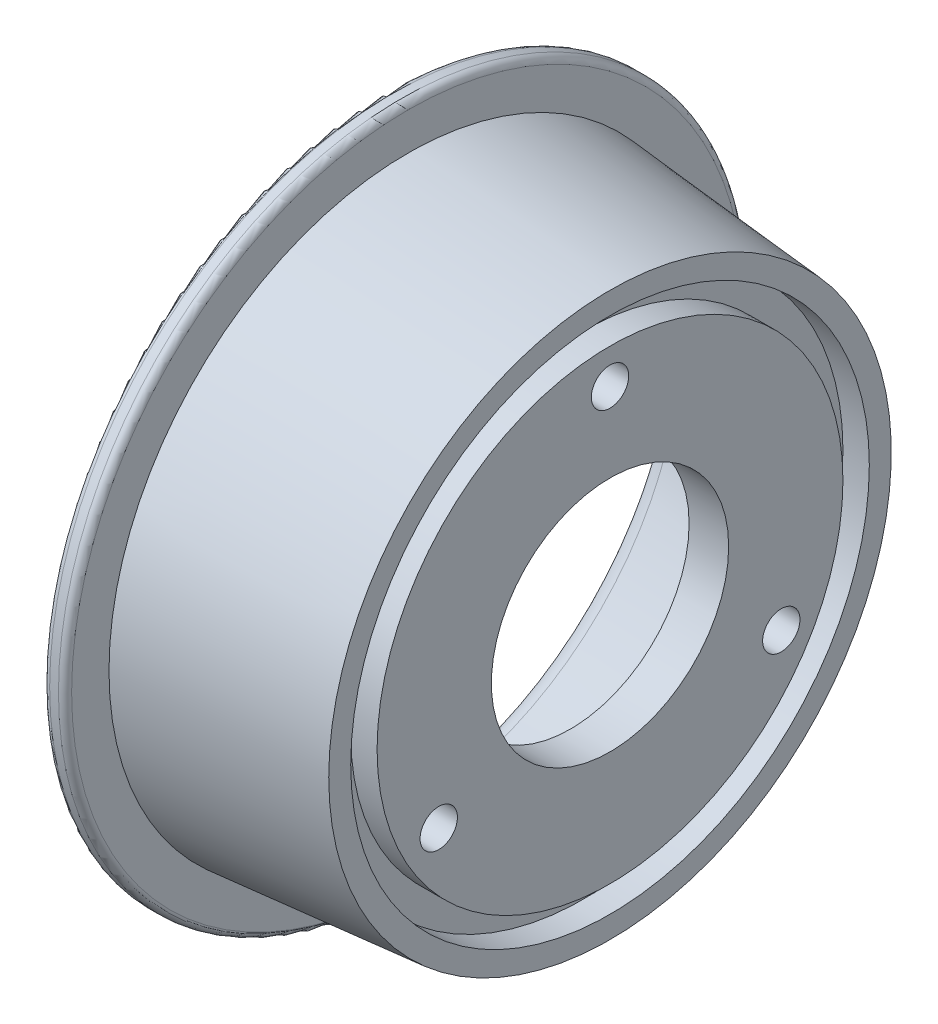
from build123d import *

# Parameters (mm, degrees)
ESQUISSE2_R                  = 27
ENL_V_MAT_EXTRU_1_DEPTH      = 162.332407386
ESQUISSE3_R                  = 4.25
ENL_V_MAT_EXTRU_2_DEPTH      = 162.332407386
R_P_TITION_CIRCULAIRE1_COUNT = 3


with BuildPart() as part:
    # Esquisse1 → Base-R_volution (revolve)
    with BuildSketch(Plane.XY, mode=Mode.PRIVATE) as base_r_volution_sk:
        with BuildLine():
            Line((-57.192466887, -53.693377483), (-48.192466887, -53.693377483))
            Line((-48.192466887, -53.693377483), (-48.192466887, -0.693377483))
            Line((-48.192466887, -0.693377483), (-54.192466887, -0.693377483))
            Line((-54.192466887, -0.693377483), (-54.192466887, 5.306622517))
            Line((-54.192466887, 5.306622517), (-48.192466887, 5.306622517))
            Line((-48.192466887, 5.306622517), (-48.192466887, 10.306622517))
            Line((-48.192466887, 10.306622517), (-94.192466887, 14.306622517))
            Line((-94.192466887, 14.306622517), (-94.192466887, 22.806622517))
            ThreePointArc((-94.192466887, 22.806622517), (-94.631806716, 23.867282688), (-95.692466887, 24.306622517))
            Line((-95.692466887, 24.306622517), (-97.692466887, 24.306622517))
            ThreePointArc((-97.692466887, 24.306622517), (-98.753127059, 23.867282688), (-99.192466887, 22.806622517))
            Line((-99.192466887, 22.806622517), (-99.192466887, 13.907286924))
            ThreePointArc((-99.192466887, 13.907286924), (-97.871878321, 10.521739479), (-94.607694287, 8.924558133))
            Line((-94.607694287, 8.924558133), (-57.192466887, 5.806622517))
            Line((-57.192466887, 5.806622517), (-57.192466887, -53.693377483))
        make_face()
    revolve(base_r_volution_sk.sketch.rotate(Axis((-48.192466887, -53.693377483, 0), (1, 0, 0)), 90), axis=Axis((-48.192466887, -53.693377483, 0), (1, 0, 0)))

    # Esquisse2 → Enl_v. mat.-Extru.1 (cut, through all)
    with BuildSketch(Plane(origin=(-48.192466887, 0, 0), x_dir=(0, 0, -1), z_dir=(1, 0, 0))):
        with Locations((0, -53.693377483)):
            Circle(ESQUISSE2_R)
    extrude(amount=-ENL_V_MAT_EXTRU_1_DEPTH, mode=Mode.SUBTRACT)

    # Esquisse3 → Enl_v. mat.-Extru.2 (cut, through all)
    with BuildSketch(Plane(origin=(-48.192466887, 0, 0), x_dir=(0, 0, -1), z_dir=(1, 0, 0))):
        with Locations((-38.97114317, -76.193377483)):
            Circle(ESQUISSE3_R)
    enl_v_mat_extru_2 = extrude(amount=-ENL_V_MAT_EXTRU_2_DEPTH, mode=Mode.SUBTRACT)

    # R_p_tition circulaire1: Enl_v. mat.-Extru.2 ×3 about axis
    r_p_tition_circulaire1_axis = Axis((0, -53.693377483, 0), (-1, 0, 0))
    for i in range(1, R_P_TITION_CIRCULAIRE1_COUNT):
        add(enl_v_mat_extru_2.rotate(r_p_tition_circulaire1_axis, i * 360 / R_P_TITION_CIRCULAIRE1_COUNT), mode=Mode.SUBTRACT)


solid = part.part
